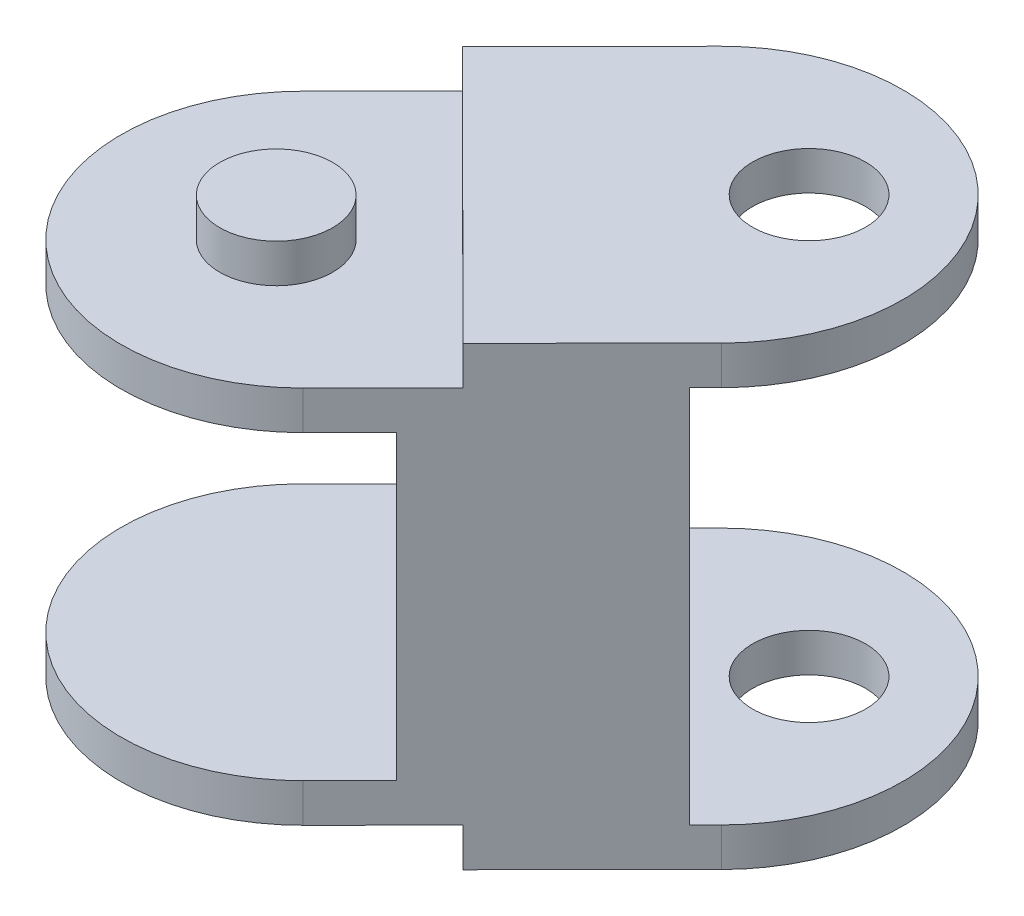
ISO-10303-21;
HEADER;
FILE_DESCRIPTION(('STEP AP214'),'2;1');
FILE_NAME('part.step','',(''),(''),'','','');
FILE_SCHEMA(('AUTOMOTIVE_DESIGN { 1 0 10303 214 1 1 1 1 }'));
ENDSEC;
DATA;
#1=APPLICATION_CONTEXT('core data for automotive mechanical design processes');
#2=APPLICATION_PROTOCOL_DEFINITION('international standard','automotive_design',2000,#1);
#3=PRODUCT_CONTEXT('',#1,'mechanical');
#4=PRODUCT('Part','Part','',(#3));
#5=PRODUCT_RELATED_PRODUCT_CATEGORY('part','',(#4));
#6=PRODUCT_DEFINITION_FORMATION('','',#4);
#7=PRODUCT_DEFINITION_CONTEXT('part definition',#1,'design');
#8=PRODUCT_DEFINITION('design','',#6,#7);
#9=PRODUCT_DEFINITION_SHAPE('','',#8);
#10=(LENGTH_UNIT() NAMED_UNIT(*) SI_UNIT(.MILLI.,.METRE.));
#11=(NAMED_UNIT(*) PLANE_ANGLE_UNIT() SI_UNIT($,.RADIAN.));
#12=(NAMED_UNIT(*) SI_UNIT($,.STERADIAN.) SOLID_ANGLE_UNIT());
#13=UNCERTAINTY_MEASURE_WITH_UNIT(LENGTH_MEASURE(1.E-05),#10,'distance_accuracy_value','');
#14=(GEOMETRIC_REPRESENTATION_CONTEXT(3) GLOBAL_UNCERTAINTY_ASSIGNED_CONTEXT((#13)) GLOBAL_UNIT_ASSIGNED_CONTEXT((#10,
#11,#12)) REPRESENTATION_CONTEXT('',''));
#15=CARTESIAN_POINT('',(0.,0.,0.));
#16=DIRECTION('',(0.,0.,1.));
#17=DIRECTION('',(1.,0.,0.));
#18=AXIS2_PLACEMENT_3D('',#15,#16,#17);
#19=CARTESIAN_POINT('',(-554.0128570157,20.1,16.2439000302));
#20=DIRECTION('',(0.,1.,0.));
#21=DIRECTION('',(0.,0.,1.));
#22=AXIS2_PLACEMENT_3D('',#19,#20,#21);
#23=PLANE('',#22);
#24=CARTESIAN_POINT('',(-554.0128570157,20.1,16.2439000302));
#25=DIRECTION('',(0.,-1.,0.));
#26=DIRECTION('',(0.,0.,-1.));
#27=AXIS2_PLACEMENT_3D('',#24,#25,#26);
#28=CIRCLE('',#27,2.99999999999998);
#29=CARTESIAN_POINT('',(-554.0128570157,20.1,13.2439000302));
#30=VERTEX_POINT('',#29);
#31=EDGE_CURVE('E381',#30,#30,#28,.T.);
#32=ORIENTED_EDGE('',*,*,#31,.F.);
#33=EDGE_LOOP('',(#32));
#34=FACE_BOUND('',#33,.T.);
#35=ADVANCED_FACE('F17',(#34),#23,.T.);
#36=CARTESIAN_POINT('',(-543.068753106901,8.,5.26771719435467));
#37=DIRECTION('',(0.706071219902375,0.,-0.708140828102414));
#38=DIRECTION('',(-0.708140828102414,0.,-0.706071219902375));
#39=AXIS2_PLACEMENT_3D('',#36,#37,#38);
#40=PLANE('',#39);
#41=DIRECTION('',(0.,1.,0.));
#42=VECTOR('',#41,1.);
#43=CARTESIAN_POINT('',(-549.902312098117,20.1,-1.5458700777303));
#44=LINE('',#43,#42);
#45=CARTESIAN_POINT('',(-549.902312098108,18.05,-1.54587007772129));
#46=VERTEX_POINT('',#45);
#47=CARTESIAN_POINT('',(-549.902312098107,16.,-1.54587007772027));
#48=VERTEX_POINT('',#47);
#49=EDGE_CURVE('E390',#46,#48,#44,.F.);
#50=ORIENTED_EDGE('',*,*,#49,.F.);
#51=DIRECTION('',(-0.708140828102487,0.,-0.706071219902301));
#52=VECTOR('',#51,1.);
#53=CARTESIAN_POINT('',(-549.273477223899,18.05,-0.918873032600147));
#54=LINE('',#53,#52);
#55=CARTESIAN_POINT('',(-549.273477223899,18.05,-0.918873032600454));
#56=VERTEX_POINT('',#55);
#57=EDGE_CURVE('E393',#56,#46,#54,.T.);
#58=ORIENTED_EDGE('',*,*,#57,.F.);
#59=DIRECTION('',(0.,-1.,0.));
#60=VECTOR('',#59,1.);
#61=CARTESIAN_POINT('',(-549.273477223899,17.025,-0.918873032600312));
#62=LINE('',#61,#60);
#63=CARTESIAN_POINT('',(-549.273477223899,16.,-0.91887303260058));
#64=VERTEX_POINT('',#63);
#65=EDGE_CURVE('E378',#56,#64,#62,.T.);
#66=ORIENTED_EDGE('',*,*,#65,.T.);
#67=DIRECTION('',(-0.708140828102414,0.,-0.706071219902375));
#68=VECTOR('',#67,1.);
#69=CARTESIAN_POINT('',(-543.068753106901,16.,5.26771719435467));
#70=LINE('',#69,#68);
#71=EDGE_CURVE('E236',#64,#48,#70,.T.);
#72=ORIENTED_EDGE('',*,*,#71,.T.);
#73=EDGE_LOOP('',(#50,#58,#66,#72));
#74=FACE_BOUND('',#73,.T.);
#75=ADVANCED_FACE('F798',(#74),#40,.T.);
#76=CARTESIAN_POINT('',(-556.220511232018,8.,5.5698069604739));
#77=DIRECTION('',(0.706071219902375,0.,-0.708140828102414));
#78=DIRECTION('',(-0.708140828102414,0.,-0.706071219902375));
#79=AXIS2_PLACEMENT_3D('',#76,#77,#78);
#80=PLANE('',#79);
#81=DIRECTION('',(0.,1.,0.));
#82=VECTOR('',#81,1.);
#83=CARTESIAN_POINT('',(-555.831033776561,8.,5.95814613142));
#84=LINE('',#83,#82);
#85=CARTESIAN_POINT('',(-555.831033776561,10.,5.95814613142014));
#86=VERTEX_POINT('',#85);
#87=CARTESIAN_POINT('',(-555.831033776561,16.,5.95814613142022));
#88=VERTEX_POINT('',#87);
#89=EDGE_CURVE('E230',#86,#88,#84,.T.);
#90=ORIENTED_EDGE('',*,*,#89,.T.);
#91=DIRECTION('',(-0.708140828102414,0.,-0.706071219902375));
#92=VECTOR('',#91,1.);
#93=CARTESIAN_POINT('',(-556.220511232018,16.,5.5698069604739));
#94=LINE('',#93,#92);
#95=CARTESIAN_POINT('',(-556.609988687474,16.,5.18146778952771));
#96=VERTEX_POINT('',#95);
#97=EDGE_CURVE('E225',#96,#88,#94,.F.);
#98=ORIENTED_EDGE('',*,*,#97,.F.);
#99=DIRECTION('',(0.,1.,0.));
#100=VECTOR('',#99,1.);
#101=CARTESIAN_POINT('',(-556.609988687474,20.1,5.18146778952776));
#102=LINE('',#101,#100);
#103=CARTESIAN_POINT('',(-556.609988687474,10.,5.18146778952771));
#104=VERTEX_POINT('',#103);
#105=EDGE_CURVE('E229',#104,#96,#102,.T.);
#106=ORIENTED_EDGE('',*,*,#105,.F.);
#107=DIRECTION('',(-0.708140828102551,0.,-0.706071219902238));
#108=VECTOR('',#107,1.);
#109=CARTESIAN_POINT('',(-555.831033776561,10.,5.95814613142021));
#110=LINE('',#109,#108);
#111=EDGE_CURVE('E407',#86,#104,#110,.T.);
#112=ORIENTED_EDGE('',*,*,#111,.F.);
#113=EDGE_LOOP('',(#90,#98,#106,#112));
#114=FACE_BOUND('',#113,.T.);
#115=ADVANCED_FACE('F227',(#114),#80,.F.);
#116=CARTESIAN_POINT('',(-550.571941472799,8.,-0.0953196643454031));
#117=DIRECTION('',(-0.706071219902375,0.,0.708140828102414));
#118=DIRECTION('',(0.708140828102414,0.,0.706071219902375));
#119=AXIS2_PLACEMENT_3D('',#116,#117,#118);
#120=PLANE('',#119);
#121=DIRECTION('',(0.,1.,0.));
#122=VECTOR('',#121,1.);
#123=CARTESIAN_POINT('',(-550.961418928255,20.1,-0.483658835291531));
#124=LINE('',#123,#122);
#125=CARTESIAN_POINT('',(-550.961418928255,16.,-0.483658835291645));
#126=VERTEX_POINT('',#125);
#127=CARTESIAN_POINT('',(-550.961418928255,10.,-0.483658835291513));
#128=VERTEX_POINT('',#127);
#129=EDGE_CURVE('E424',#126,#128,#124,.F.);
#130=ORIENTED_EDGE('',*,*,#129,.F.);
#131=DIRECTION('',(0.708140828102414,0.,0.706071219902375));
#132=VECTOR('',#131,1.);
#133=CARTESIAN_POINT('',(-550.571941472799,16.,-0.0953196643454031));
#134=LINE('',#133,#132);
#135=CARTESIAN_POINT('',(-550.182464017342,16.,0.293019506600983));
#136=VERTEX_POINT('',#135);
#137=EDGE_CURVE('E235',#136,#126,#134,.F.);
#138=ORIENTED_EDGE('',*,*,#137,.F.);
#139=DIRECTION('',(0.,1.,0.));
#140=VECTOR('',#139,1.);
#141=CARTESIAN_POINT('',(-550.182464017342,8.,0.293019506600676));
#142=LINE('',#141,#140);
#143=CARTESIAN_POINT('',(-550.182464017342,10.,0.293019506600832));
#144=VERTEX_POINT('',#143);
#145=EDGE_CURVE('E436',#136,#144,#142,.F.);
#146=ORIENTED_EDGE('',*,*,#145,.T.);
#147=DIRECTION('',(0.7081408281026,0.,0.706071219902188));
#148=VECTOR('',#147,1.);
#149=CARTESIAN_POINT('',(-550.961418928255,10.,-0.483658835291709));
#150=LINE('',#149,#148);
#151=EDGE_CURVE('E402',#128,#144,#150,.T.);
#152=ORIENTED_EDGE('',*,*,#151,.F.);
#153=EDGE_LOOP('',(#130,#138,#146,#152));
#154=FACE_BOUND('',#153,.T.);
#155=ADVANCED_FACE('F792',(#154),#120,.F.);
#156=CARTESIAN_POINT('',(-553.396226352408,10.,2.73724364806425));
#157=DIRECTION('',(0.,-1.,0.));
#158=DIRECTION('',(0.,0.,-1.));
#159=AXIS2_PLACEMENT_3D('',#156,#157,#158);
#160=PLANE('',#159);
#161=ORIENTED_EDGE('',*,*,#151,.T.);
#162=DIRECTION('',(-0.706071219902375,0.,0.708140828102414));
#163=VECTOR('',#162,1.);
#164=CARTESIAN_POINT('',(-553.006748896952,10.,3.12558281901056));
#165=LINE('',#164,#163);
#166=EDGE_CURVE('E432',#144,#86,#165,.T.);
#167=ORIENTED_EDGE('',*,*,#166,.T.);
#168=ORIENTED_EDGE('',*,*,#111,.T.);
#169=DIRECTION('',(-0.706071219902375,0.,0.708140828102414));
#170=VECTOR('',#169,1.);
#171=CARTESIAN_POINT('',(-554.597685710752,10.,3.16326642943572));
#172=LINE('',#171,#170);
#173=EDGE_CURVE('E246',#128,#104,#172,.T.);
#174=ORIENTED_EDGE('',*,*,#173,.F.);
#175=EDGE_LOOP('',(#161,#167,#168,#174));
#176=FACE_BOUND('',#175,.T.);
#177=ADVANCED_FACE('F788',(#176),#160,.T.);
#178=CARTESIAN_POINT('',(-554.0128570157,-4.1,16.2439000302));
#179=DIRECTION('',(0.,-1.,0.));
#180=DIRECTION('',(0.,0.,-1.));
#181=AXIS2_PLACEMENT_3D('',#178,#179,#180);
#182=PLANE('',#181);
#183=CARTESIAN_POINT('',(-554.0128570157,-4.1,16.2439000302));
#184=DIRECTION('',(0.,-1.,0.));
#185=DIRECTION('',(0.,0.,-1.));
#186=AXIS2_PLACEMENT_3D('',#183,#184,#185);
#187=CIRCLE('',#186,2.99999999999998);
#188=CARTESIAN_POINT('',(-554.0128570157,-4.1,13.2439000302));
#189=VERTEX_POINT('',#188);
#190=EDGE_CURVE('E435',#189,#189,#187,.F.);
#191=ORIENTED_EDGE('',*,*,#190,.F.);
#192=EDGE_LOOP('',(#191));
#193=FACE_BOUND('',#192,.T.);
#194=ADVANCED_FACE('F785',(#193),#182,.T.);
#195=CARTESIAN_POINT('',(-536.008040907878,18.05,-1.81369108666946));
#196=DIRECTION('',(0.,-1.,0.));
#197=DIRECTION('',(0.,0.,-1.));
#198=AXIS2_PLACEMENT_3D('',#195,#196,#197);
#199=PLANE('',#198);
#200=CARTESIAN_POINT('',(-539.891432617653,18.05,2.08108346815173));
#201=DIRECTION('',(0.,-1.,0.));
#202=DIRECTION('',(0.,0.,-1.));
#203=AXIS2_PLACEMENT_3D('',#200,#201,#202);
#204=CIRCLE('',#203,2.99999999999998);
#205=CARTESIAN_POINT('',(-539.891432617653,18.05,-0.918916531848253));
#206=VERTEX_POINT('',#205);
#207=EDGE_CURVE('E20',#206,#206,#204,.F.);
#208=ORIENTED_EDGE('',*,*,#207,.T.);
#209=EDGE_LOOP('',(#208));
#210=FACE_BOUND('',#209,.T.);
#211=ORIENTED_EDGE('',*,*,#57,.T.);
#212=DIRECTION('',(-0.706071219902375,0.,0.708140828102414));
#213=VECTOR('',#212,1.);
#214=CARTESIAN_POINT('',(-554.597685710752,18.05,3.16326642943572));
#215=LINE('',#214,#213);
#216=CARTESIAN_POINT('',(-549.055026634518,18.05,-2.3956390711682));
#217=VERTEX_POINT('',#216);
#218=EDGE_CURVE('E247',#217,#46,#215,.T.);
#219=ORIENTED_EDGE('',*,*,#218,.F.);
#220=CARTESIAN_POINT('',(-542.22146764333,18.05,4.4179482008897));
#221=DIRECTION('',(0.,-1.,0.));
#222=DIRECTION('',(0.,0.,-1.));
#223=AXIS2_PLACEMENT_3D('',#220,#221,#222);
#224=CIRCLE('',#223,9.65000000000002);
#225=CARTESIAN_POINT('',(-535.387908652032,18.05,11.231535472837));
#226=VERTEX_POINT('',#225);
#227=EDGE_CURVE('E387',#226,#217,#224,.F.);
#228=ORIENTED_EDGE('',*,*,#227,.F.);
#229=DIRECTION('',(-0.706071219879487,0.,0.708140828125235));
#230=VECTOR('',#229,1.);
#231=CARTESIAN_POINT('',(-535.387908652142,18.05,11.2315354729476));
#232=LINE('',#231,#230);
#233=CARTESIAN_POINT('',(-536.235194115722,18.05,12.0813044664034));
#234=VERTEX_POINT('',#233);
#235=EDGE_CURVE('E398',#226,#234,#232,.T.);
#236=ORIENTED_EDGE('',*,*,#235,.T.);
#237=DIRECTION('',(-0.708140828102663,0.,-0.706071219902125));
#238=VECTOR('',#237,1.);
#239=CARTESIAN_POINT('',(-536.235194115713,18.05,12.0813044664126));
#240=LINE('',#239,#238);
#241=CARTESIAN_POINT('',(-536.864028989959,18.05,11.4543074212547));
#242=VERTEX_POINT('',#241);
#243=EDGE_CURVE('E139',#234,#242,#240,.T.);
#244=ORIENTED_EDGE('',*,*,#243,.T.);
#245=CARTESIAN_POINT('',(-539.891432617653,18.05,2.08108346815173));
#246=DIRECTION('',(0.,-1.,0.));
#247=DIRECTION('',(0.,0.,-1.));
#248=AXIS2_PLACEMENT_3D('',#245,#246,#247);
#249=CIRCLE('',#248,9.85000000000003);
#250=EDGE_CURVE('E498',#242,#56,#249,.T.);
#251=ORIENTED_EDGE('',*,*,#250,.T.);
#252=EDGE_LOOP('',(#211,#219,#228,#236,#244,#251));
#253=FACE_BOUND('',#252,.T.);
#254=ADVANCED_FACE('F507',(#210,#253),#199,.T.);
#255=CARTESIAN_POINT('',(-539.891432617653,19.075,2.08108346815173));
#256=DIRECTION('',(0.,-1.,0.));
#257=DIRECTION('',(0.,0.,-1.));
#258=AXIS2_PLACEMENT_3D('',#255,#256,#257);
#259=CYLINDRICAL_SURFACE('',#258,2.99999999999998);
#260=ORIENTED_EDGE('',*,*,#207,.F.);
#261=EDGE_LOOP('',(#260));
#262=FACE_BOUND('',#261,.T.);
#263=CARTESIAN_POINT('',(-539.891432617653,20.1,2.08108346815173));
#264=DIRECTION('',(0.,-1.,0.));
#265=DIRECTION('',(0.,0.,-1.));
#266=AXIS2_PLACEMENT_3D('',#263,#264,#265);
#267=CIRCLE('',#266,2.99999999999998);
#268=CARTESIAN_POINT('',(-539.891432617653,20.1,-0.918916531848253));
#269=VERTEX_POINT('',#268);
#270=EDGE_CURVE('E383',#269,#269,#267,.F.);
#271=ORIENTED_EDGE('',*,*,#270,.T.);
#272=EDGE_LOOP('',(#271));
#273=FACE_BOUND('',#272,.T.);
#274=ADVANCED_FACE('F509',(#262,#273),#259,.F.);
#275=CARTESIAN_POINT('',(-554.0128570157,19.075,16.2439000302));
#276=DIRECTION('',(0.,-1.,0.));
#277=DIRECTION('',(0.,0.,-1.));
#278=AXIS2_PLACEMENT_3D('',#275,#276,#277);
#279=CYLINDRICAL_SURFACE('',#278,2.99999999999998);
#280=ORIENTED_EDGE('',*,*,#31,.T.);
#281=EDGE_LOOP('',(#280));
#282=FACE_BOUND('',#281,.T.);
#283=CARTESIAN_POINT('',(-554.0128570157,18.05,16.2439000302));
#284=DIRECTION('',(0.,-1.,0.));
#285=DIRECTION('',(0.,0.,-1.));
#286=AXIS2_PLACEMENT_3D('',#283,#284,#285);
#287=CIRCLE('',#286,2.99999999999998);
#288=CARTESIAN_POINT('',(-554.0128570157,18.05,13.2439000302));
#289=VERTEX_POINT('',#288);
#290=EDGE_CURVE('E284',#289,#289,#287,.F.);
#291=ORIENTED_EDGE('',*,*,#290,.T.);
#292=EDGE_LOOP('',(#291));
#293=FACE_BOUND('',#292,.T.);
#294=ADVANCED_FACE('F512',(#282,#293),#279,.T.);
#295=CARTESIAN_POINT('',(-554.597685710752,20.1,3.16326642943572));
#296=DIRECTION('',(-0.708140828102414,0.,-0.706071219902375));
#297=DIRECTION('',(-0.706071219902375,0.,0.708140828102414));
#298=AXIS2_PLACEMENT_3D('',#295,#296,#297);
#299=PLANE('',#298);
#300=DIRECTION('',(-0.706071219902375,0.,0.708140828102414));
#301=VECTOR('',#300,1.);
#302=CARTESIAN_POINT('',(-554.597685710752,16.,3.16326642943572));
#303=LINE('',#302,#301);
#304=EDGE_CURVE('E410',#48,#126,#303,.T.);
#305=ORIENTED_EDGE('',*,*,#304,.T.);
#306=ORIENTED_EDGE('',*,*,#129,.T.);
#307=ORIENTED_EDGE('',*,*,#173,.T.);
#308=ORIENTED_EDGE('',*,*,#105,.T.);
#309=DIRECTION('',(0.706071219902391,0.,-0.708140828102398));
#310=VECTOR('',#309,1.);
#311=CARTESIAN_POINT('',(-560.140344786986,16.,8.72217193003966));
#312=LINE('',#311,#310);
#313=CARTESIAN_POINT('',(-560.140344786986,16.,8.72217193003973));
#314=VERTEX_POINT('',#313);
#315=EDGE_CURVE('E243',#314,#96,#312,.T.);
#316=ORIENTED_EDGE('',*,*,#315,.F.);
#317=DIRECTION('',(0.,-1.,0.));
#318=VECTOR('',#317,1.);
#319=CARTESIAN_POINT('',(-560.140344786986,20.1,8.72217193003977));
#320=LINE('',#319,#318);
#321=CARTESIAN_POINT('',(-560.140344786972,18.05,8.72217193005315));
#322=VERTEX_POINT('',#321);
#323=EDGE_CURVE('E375',#322,#314,#320,.T.);
#324=ORIENTED_EDGE('',*,*,#323,.F.);
#325=DIRECTION('',(0.706071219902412,0.,-0.708140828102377));
#326=VECTOR('',#325,1.);
#327=CARTESIAN_POINT('',(-560.140344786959,18.05,8.72217193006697));
#328=LINE('',#327,#326);
#329=CARTESIAN_POINT('',(-555.90391746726,18.05,4.47332696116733));
#330=VERTEX_POINT('',#329);
#331=EDGE_CURVE('E275',#322,#330,#328,.T.);
#332=ORIENTED_EDGE('',*,*,#331,.T.);
#333=DIRECTION('',(0.,1.,0.));
#334=VECTOR('',#333,1.);
#335=CARTESIAN_POINT('',(-555.90391746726,19.075,4.47332696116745));
#336=LINE('',#335,#334);
#337=CARTESIAN_POINT('',(-555.90391746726,20.1,4.47332696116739));
#338=VERTEX_POINT('',#337);
#339=EDGE_CURVE('E293',#338,#330,#336,.F.);
#340=ORIENTED_EDGE('',*,*,#339,.F.);
#341=DIRECTION('',(0.706071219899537,0.,-0.708140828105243));
#342=VECTOR('',#341,1.);
#343=CARTESIAN_POINT('',(-555.90391746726,20.1,4.47332696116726));
#344=LINE('',#343,#342);
#345=CARTESIAN_POINT('',(-549.055026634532,20.1,-2.39563907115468));
#346=VERTEX_POINT('',#345);
#347=EDGE_CURVE('E300',#338,#346,#344,.T.);
#348=ORIENTED_EDGE('',*,*,#347,.T.);
#349=DIRECTION('',(0.,-1.,0.));
#350=VECTOR('',#349,1.);
#351=CARTESIAN_POINT('',(-549.055026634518,20.1,-2.39563907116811));
#352=LINE('',#351,#350);
#353=EDGE_CURVE('E304',#217,#346,#352,.F.);
#354=ORIENTED_EDGE('',*,*,#353,.F.);
#355=ORIENTED_EDGE('',*,*,#218,.T.);
#356=ORIENTED_EDGE('',*,*,#49,.T.);
#357=EDGE_LOOP('',(#305,#306,#307,#308,#316,#324,#332,#340,#348,#354,#355,#356));
#358=FACE_BOUND('',#357,.T.);
#359=ADVANCED_FACE('F241',(#358),#299,.T.);
#360=CARTESIAN_POINT('',(-553.006748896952,8.,3.12558281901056));
#361=DIRECTION('',(-0.708140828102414,0.,-0.706071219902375));
#362=DIRECTION('',(-0.706071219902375,0.,0.708140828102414));
#363=AXIS2_PLACEMENT_3D('',#360,#361,#362);
#364=PLANE('',#363);
#365=ORIENTED_EDGE('',*,*,#145,.F.);
#366=DIRECTION('',(0.706071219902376,0.,-0.708140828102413));
#367=VECTOR('',#366,1.);
#368=CARTESIAN_POINT('',(-555.831033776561,16.,5.95814613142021));
#369=LINE('',#368,#367);
#370=EDGE_CURVE('E255',#88,#136,#369,.T.);
#371=ORIENTED_EDGE('',*,*,#370,.F.);
#372=ORIENTED_EDGE('',*,*,#89,.F.);
#373=ORIENTED_EDGE('',*,*,#166,.F.);
#374=EDGE_LOOP('',(#365,#371,#372,#373));
#375=FACE_BOUND('',#374,.T.);
#376=ADVANCED_FACE('F770',(#375),#364,.F.);
#377=CARTESIAN_POINT('',(-554.0128570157,-3.075,16.2439000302));
#378=DIRECTION('',(0.,-1.,0.));
#379=DIRECTION('',(0.,0.,-1.));
#380=AXIS2_PLACEMENT_3D('',#377,#378,#379);
#381=CYLINDRICAL_SURFACE('',#380,2.99999999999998);
#382=CARTESIAN_POINT('',(-554.0128570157,-2.05,16.2439000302));
#383=DIRECTION('',(0.,-1.,0.));
#384=DIRECTION('',(0.,0.,-1.));
#385=AXIS2_PLACEMENT_3D('',#382,#383,#384);
#386=CIRCLE('',#385,2.99999999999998);
#387=CARTESIAN_POINT('',(-554.0128570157,-2.05,13.2439000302));
#388=VERTEX_POINT('',#387);
#389=EDGE_CURVE('E473',#388,#388,#386,.F.);
#390=ORIENTED_EDGE('',*,*,#389,.F.);
#391=EDGE_LOOP('',(#390));
#392=FACE_BOUND('',#391,.T.);
#393=ORIENTED_EDGE('',*,*,#190,.T.);
#394=EDGE_LOOP('',(#393));
#395=FACE_BOUND('',#394,.T.);
#396=ADVANCED_FACE('F760',(#392,#395),#381,.T.);
#397=CARTESIAN_POINT('',(-539.891432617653,-3.075,2.08108346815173));
#398=DIRECTION('',(0.,-1.,0.));
#399=DIRECTION('',(0.,0.,-1.));
#400=AXIS2_PLACEMENT_3D('',#397,#398,#399);
#401=CYLINDRICAL_SURFACE('',#400,2.99999999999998);
#402=CARTESIAN_POINT('',(-539.891432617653,-4.1,2.08108346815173));
#403=DIRECTION('',(0.,-1.,0.));
#404=DIRECTION('',(0.,0.,-1.));
#405=AXIS2_PLACEMENT_3D('',#402,#403,#404);
#406=CIRCLE('',#405,2.99999999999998);
#407=CARTESIAN_POINT('',(-539.891432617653,-4.1,-0.918916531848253));
#408=VERTEX_POINT('',#407);
#409=EDGE_CURVE('E478',#408,#408,#406,.F.);
#410=ORIENTED_EDGE('',*,*,#409,.F.);
#411=EDGE_LOOP('',(#410));
#412=FACE_BOUND('',#411,.T.);
#413=CARTESIAN_POINT('',(-539.891432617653,-2.05,2.08108346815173));
#414=DIRECTION('',(0.,-1.,0.));
#415=DIRECTION('',(0.,0.,-1.));
#416=AXIS2_PLACEMENT_3D('',#413,#414,#415);
#417=CIRCLE('',#416,2.99999999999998);
#418=CARTESIAN_POINT('',(-539.891432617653,-2.05,-0.918916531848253));
#419=VERTEX_POINT('',#418);
#420=EDGE_CURVE('E345',#419,#419,#417,.F.);
#421=ORIENTED_EDGE('',*,*,#420,.T.);
#422=EDGE_LOOP('',(#421));
#423=FACE_BOUND('',#422,.T.);
#424=ADVANCED_FACE('F757',(#412,#423),#401,.F.);
#425=CARTESIAN_POINT('',(-539.891432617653,17.025,2.08108346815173));
#426=DIRECTION('',(0.,-1.,0.));
#427=DIRECTION('',(0.,0.,-1.));
#428=AXIS2_PLACEMENT_3D('',#425,#426,#427);
#429=CYLINDRICAL_SURFACE('',#428,9.85000000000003);
#430=ORIENTED_EDGE('',*,*,#250,.F.);
#431=DIRECTION('',(0.,1.,0.));
#432=VECTOR('',#431,1.);
#433=CARTESIAN_POINT('',(-536.864028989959,8.,11.4543074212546));
#434=LINE('',#433,#432);
#435=CARTESIAN_POINT('',(-536.864028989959,16.,11.4543074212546));
#436=VERTEX_POINT('',#435);
#437=EDGE_CURVE('E344',#436,#242,#434,.T.);
#438=ORIENTED_EDGE('',*,*,#437,.F.);
#439=CARTESIAN_POINT('',(-539.891432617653,16.,2.08108346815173));
#440=DIRECTION('',(0.,-1.,0.));
#441=DIRECTION('',(0.,0.,-1.));
#442=AXIS2_PLACEMENT_3D('',#439,#440,#441);
#443=CIRCLE('',#442,9.85000000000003);
#444=CARTESIAN_POINT('',(-537.650352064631,16.,11.672749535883));
#445=VERTEX_POINT('',#444);
#446=EDGE_CURVE('E495',#436,#445,#443,.T.);
#447=ORIENTED_EDGE('',*,*,#446,.T.);
#448=CARTESIAN_POINT('',(-539.891432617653,16.,2.08108346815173));
#449=DIRECTION('',(0.,-1.,0.));
#450=DIRECTION('',(0.,0.,-1.));
#451=AXIS2_PLACEMENT_3D('',#448,#449,#450);
#452=CIRCLE('',#451,9.85000000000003);
#453=EDGE_CURVE('E259',#64,#445,#452,.F.);
#454=ORIENTED_EDGE('',*,*,#453,.F.);
#455=ORIENTED_EDGE('',*,*,#65,.F.);
#456=EDGE_LOOP('',(#430,#438,#447,#454,#455));
#457=FACE_BOUND('',#456,.T.);
#458=ADVANCED_FACE('F759',(#457),#429,.F.);
#459=CARTESIAN_POINT('',(-539.891432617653,16.,2.08108346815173));
#460=DIRECTION('',(0.,-1.,0.));
#461=DIRECTION('',(0.,0.,-1.));
#462=AXIS2_PLACEMENT_3D('',#459,#460,#461);
#463=PLANE('',#462);
#464=ORIENTED_EDGE('',*,*,#446,.F.);
#465=DIRECTION('',(-0.708140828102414,0.,-0.706071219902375));
#466=VECTOR('',#465,1.);
#467=CARTESIAN_POINT('',(-543.068753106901,16.,5.26771719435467));
#468=LINE('',#467,#466);
#469=CARTESIAN_POINT('',(-537.149120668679,16.,11.1700489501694));
#470=VERTEX_POINT('',#469);
#471=EDGE_CURVE('E341',#470,#436,#468,.F.);
#472=ORIENTED_EDGE('',*,*,#471,.F.);
#473=DIRECTION('',(0.706071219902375,0.,-0.708140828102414));
#474=VECTOR('',#473,1.);
#475=CARTESIAN_POINT('',(-541.032512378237,16.,15.0648235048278));
#476=LINE('',#475,#474);
#477=EDGE_CURVE('E329',#470,#445,#476,.F.);
#478=ORIENTED_EDGE('',*,*,#477,.T.);
#479=EDGE_LOOP('',(#464,#472,#478));
#480=FACE_BOUND('',#479,.T.);
#481=ADVANCED_FACE('F767',(#480),#463,.F.);
#482=CARTESIAN_POINT('',(-542.22146764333,20.1,4.4179482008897));
#483=DIRECTION('',(0.,-1.,0.));
#484=DIRECTION('',(0.,0.,-1.));
#485=AXIS2_PLACEMENT_3D('',#482,#483,#484);
#486=CYLINDRICAL_SURFACE('',#485,9.65000000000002);
#487=CARTESIAN_POINT('',(-542.22146764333,20.1,4.4179482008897));
#488=DIRECTION('',(0.,-1.,0.));
#489=DIRECTION('',(0.,0.,-1.));
#490=AXIS2_PLACEMENT_3D('',#487,#488,#489);
#491=CIRCLE('',#490,9.65000000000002);
#492=CARTESIAN_POINT('',(-535.387908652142,20.1,11.2315354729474));
#493=VERTEX_POINT('',#492);
#494=EDGE_CURVE('E303',#346,#493,#491,.T.);
#495=ORIENTED_EDGE('',*,*,#494,.T.);
#496=DIRECTION('',(0.,1.,0.));
#497=VECTOR('',#496,1.);
#498=CARTESIAN_POINT('',(-535.387908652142,20.1,11.2315354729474));
#499=LINE('',#498,#497);
#500=EDGE_CURVE('E297',#226,#493,#499,.T.);
#501=ORIENTED_EDGE('',*,*,#500,.F.);
#502=ORIENTED_EDGE('',*,*,#227,.T.);
#503=ORIENTED_EDGE('',*,*,#353,.T.);
#504=EDGE_LOOP('',(#495,#501,#502,#503));
#505=FACE_BOUND('',#504,.T.);
#506=ADVANCED_FACE('F520',(#505),#486,.T.);
#507=CARTESIAN_POINT('',(-547.764126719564,20.1,9.97685370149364));
#508=DIRECTION('',(0.,-1.,0.));
#509=DIRECTION('',(0.,0.,-1.));
#510=AXIS2_PLACEMENT_3D('',#507,#508,#509);
#511=PLANE('',#510);
#512=ORIENTED_EDGE('',*,*,#270,.F.);
#513=EDGE_LOOP('',(#512));
#514=FACE_BOUND('',#513,.T.);
#515=DIRECTION('',(0.706071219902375,0.,-0.708140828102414));
#516=VECTOR('',#515,1.);
#517=CARTESIAN_POINT('',(-540.930567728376,20.1,16.7904409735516));
#518=LINE('',#517,#516);
#519=CARTESIAN_POINT('',(-542.236799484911,20.1,18.1005015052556));
#520=VERTEX_POINT('',#519);
#521=EDGE_CURVE('E288',#493,#520,#518,.F.);
#522=ORIENTED_EDGE('',*,*,#521,.F.);
#523=ORIENTED_EDGE('',*,*,#494,.F.);
#524=ORIENTED_EDGE('',*,*,#347,.F.);
#525=DIRECTION('',(0.708140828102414,0.,0.706071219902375));
#526=VECTOR('',#525,1.);
#527=CARTESIAN_POINT('',(-549.070358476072,20.1,11.2869142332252));
#528=LINE('',#527,#526);
#529=EDGE_CURVE('E279',#520,#338,#528,.F.);
#530=ORIENTED_EDGE('',*,*,#529,.F.);
#531=EDGE_LOOP('',(#522,#523,#524,#530));
#532=FACE_BOUND('',#531,.T.);
#533=ADVANCED_FACE('F516',(#514,#532),#511,.F.);
#534=CARTESIAN_POINT('',(-549.070358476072,19.075,11.2869142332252));
#535=DIRECTION('',(-0.706071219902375,0.,0.708140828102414));
#536=DIRECTION('',(0.708140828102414,0.,0.706071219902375));
#537=AXIS2_PLACEMENT_3D('',#534,#535,#536);
#538=PLANE('',#537);
#539=DIRECTION('',(0.,1.,0.));
#540=VECTOR('',#539,1.);
#541=CARTESIAN_POINT('',(-542.236799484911,20.1,18.1005015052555));
#542=LINE('',#541,#540);
#543=CARTESIAN_POINT('',(-542.236799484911,18.05,18.1005015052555));
#544=VERTEX_POINT('',#543);
#545=EDGE_CURVE('E272',#520,#544,#542,.F.);
#546=ORIENTED_EDGE('',*,*,#545,.F.);
#547=ORIENTED_EDGE('',*,*,#529,.T.);
#548=ORIENTED_EDGE('',*,*,#339,.T.);
#549=DIRECTION('',(0.708140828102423,0.,0.706071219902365));
#550=VECTOR('',#549,1.);
#551=CARTESIAN_POINT('',(-555.90391746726,18.05,4.47332696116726));
#552=LINE('',#551,#550);
#553=EDGE_CURVE('E278',#330,#544,#552,.T.);
#554=ORIENTED_EDGE('',*,*,#553,.T.);
#555=EDGE_LOOP('',(#546,#547,#548,#554));
#556=FACE_BOUND('',#555,.T.);
#557=ADVANCED_FACE('F519',(#556),#538,.T.);
#558=CARTESIAN_POINT('',(-554.948401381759,18.05,17.1821866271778));
#559=DIRECTION('',(0.,-1.,0.));
#560=DIRECTION('',(0.,0.,-1.));
#561=AXIS2_PLACEMENT_3D('',#558,#559,#560);
#562=PLANE('',#561);
#563=ORIENTED_EDGE('',*,*,#290,.F.);
#564=EDGE_LOOP('',(#563));
#565=FACE_BOUND('',#564,.T.);
#566=DIRECTION('',(0.706071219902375,0.,-0.708140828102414));
#567=VECTOR('',#566,1.);
#568=CARTESIAN_POINT('',(-540.930567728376,18.05,16.7904409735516));
#569=LINE('',#568,#567);
#570=CARTESIAN_POINT('',(-546.47322680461,18.05,22.3493464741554));
#571=VERTEX_POINT('',#570);
#572=EDGE_CURVE('E270',#544,#571,#569,.F.);
#573=ORIENTED_EDGE('',*,*,#572,.F.);
#574=ORIENTED_EDGE('',*,*,#553,.F.);
#575=ORIENTED_EDGE('',*,*,#331,.F.);
#576=CARTESIAN_POINT('',(-553.306785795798,18.05,15.5357592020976));
#577=DIRECTION('',(0.,-1.,0.));
#578=DIRECTION('',(0.,0.,-1.));
#579=AXIS2_PLACEMENT_3D('',#576,#577,#578);
#580=CIRCLE('',#579,9.65000000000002);
#581=EDGE_CURVE('E377',#571,#322,#580,.T.);
#582=ORIENTED_EDGE('',*,*,#581,.F.);
#583=EDGE_LOOP('',(#573,#574,#575,#582));
#584=FACE_BOUND('',#583,.T.);
#585=ADVANCED_FACE('F541',(#565,#584),#562,.F.);
#586=CARTESIAN_POINT('',(-553.306785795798,20.1,15.5357592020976));
#587=DIRECTION('',(0.,-1.,0.));
#588=DIRECTION('',(0.,0.,-1.));
#589=AXIS2_PLACEMENT_3D('',#586,#587,#588);
#590=CYLINDRICAL_SURFACE('',#589,9.65000000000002);
#591=CARTESIAN_POINT('',(-553.306785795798,16.,15.5357592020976));
#592=DIRECTION('',(0.,-1.,0.));
#593=DIRECTION('',(0.,0.,-1.));
#594=AXIS2_PLACEMENT_3D('',#591,#592,#593);
#595=CIRCLE('',#594,9.65000000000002);
#596=CARTESIAN_POINT('',(-546.47322680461,16.,22.3493464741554));
#597=VERTEX_POINT('',#596);
#598=EDGE_CURVE('E254',#597,#314,#595,.T.);
#599=ORIENTED_EDGE('',*,*,#598,.F.);
#600=DIRECTION('',(0.,1.,0.));
#601=VECTOR('',#600,1.);
#602=CARTESIAN_POINT('',(-546.473226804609,20.1,22.3493464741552));
#603=LINE('',#602,#601);
#604=EDGE_CURVE('E267',#571,#597,#603,.F.);
#605=ORIENTED_EDGE('',*,*,#604,.F.);
#606=ORIENTED_EDGE('',*,*,#581,.T.);
#607=ORIENTED_EDGE('',*,*,#323,.T.);
#608=EDGE_LOOP('',(#599,#605,#606,#607));
#609=FACE_BOUND('',#608,.T.);
#610=ADVANCED_FACE('F546',(#609),#590,.T.);
#611=CARTESIAN_POINT('',(-546.95214481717,16.,9.16249174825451));
#612=DIRECTION('',(0.,-1.,0.));
#613=DIRECTION('',(0.,0.,-1.));
#614=AXIS2_PLACEMENT_3D('',#611,#612,#613);
#615=PLANE('',#614);
#616=ORIENTED_EDGE('',*,*,#304,.F.);
#617=ORIENTED_EDGE('',*,*,#71,.F.);
#618=ORIENTED_EDGE('',*,*,#453,.T.);
#619=DIRECTION('',(0.706071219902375,0.,-0.708140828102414));
#620=VECTOR('',#619,1.);
#621=CARTESIAN_POINT('',(-541.032512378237,16.,15.0648235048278));
#622=LINE('',#621,#620);
#623=CARTESIAN_POINT('',(-544.9159040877,16.,18.9595980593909));
#624=VERTEX_POINT('',#623);
#625=EDGE_CURVE('E325',#445,#624,#622,.F.);
#626=ORIENTED_EDGE('',*,*,#625,.T.);
#627=DIRECTION('',(-0.708140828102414,0.,-0.706071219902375));
#628=VECTOR('',#627,1.);
#629=CARTESIAN_POINT('',(-544.458940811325,16.,19.4152258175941));
#630=LINE('',#629,#628);
#631=CARTESIAN_POINT('',(-544.001977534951,16.,19.8708535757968));
#632=VERTEX_POINT('',#631);
#633=EDGE_CURVE('E483',#624,#632,#630,.F.);
#634=ORIENTED_EDGE('',*,*,#633,.T.);
#635=DIRECTION('',(0.706071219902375,0.,-0.708140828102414));
#636=VECTOR('',#635,1.);
#637=CARTESIAN_POINT('',(-540.930567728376,16.,16.7904409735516));
#638=LINE('',#637,#636);
#639=EDGE_CURVE('E269',#597,#632,#638,.T.);
#640=ORIENTED_EDGE('',*,*,#639,.F.);
#641=ORIENTED_EDGE('',*,*,#598,.T.);
#642=ORIENTED_EDGE('',*,*,#315,.T.);
#643=ORIENTED_EDGE('',*,*,#97,.T.);
#644=ORIENTED_EDGE('',*,*,#370,.T.);
#645=ORIENTED_EDGE('',*,*,#137,.T.);
#646=EDGE_LOOP('',(#616,#617,#618,#626,#634,#640,#641,#642,#643,#644,#645));
#647=FACE_BOUND('',#646,.T.);
#648=ADVANCED_FACE('F251',(#647),#615,.T.);
#649=CARTESIAN_POINT('',(-544.458940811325,8.,19.4152258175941));
#650=DIRECTION('',(0.706071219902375,0.,-0.708140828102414));
#651=DIRECTION('',(-0.708140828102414,0.,-0.706071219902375));
#652=AXIS2_PLACEMENT_3D('',#649,#650,#651);
#653=PLANE('',#652);
#654=ORIENTED_EDGE('',*,*,#633,.F.);
#655=DIRECTION('',(0.,1.,0.));
#656=VECTOR('',#655,1.);
#657=CARTESIAN_POINT('',(-544.9159040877,8.,18.959598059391));
#658=LINE('',#657,#656);
#659=CARTESIAN_POINT('',(-544.9159040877,0.,18.959598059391));
#660=VERTEX_POINT('',#659);
#661=EDGE_CURVE('E328',#624,#660,#658,.F.);
#662=ORIENTED_EDGE('',*,*,#661,.T.);
#663=DIRECTION('',(-0.708140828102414,0.,-0.706071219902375));
#664=VECTOR('',#663,1.);
#665=CARTESIAN_POINT('',(-544.458940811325,0.,19.4152258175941));
#666=LINE('',#665,#664);
#667=CARTESIAN_POINT('',(-544.001977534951,0.,19.870853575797));
#668=VERTEX_POINT('',#667);
#669=EDGE_CURVE('E257',#668,#660,#666,.T.);
#670=ORIENTED_EDGE('',*,*,#669,.F.);
#671=DIRECTION('',(0.,1.,0.));
#672=VECTOR('',#671,1.);
#673=CARTESIAN_POINT('',(-544.001977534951,20.1,19.8708535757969));
#674=LINE('',#673,#672);
#675=EDGE_CURVE('E548',#632,#668,#674,.F.);
#676=ORIENTED_EDGE('',*,*,#675,.F.);
#677=EDGE_LOOP('',(#654,#662,#670,#676));
#678=FACE_BOUND('',#677,.T.);
#679=ADVANCED_FACE('F687',(#678),#653,.F.);
#680=CARTESIAN_POINT('',(-542.22146764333,20.1,4.4179482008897));
#681=DIRECTION('',(0.,-1.,0.));
#682=DIRECTION('',(0.,0.,-1.));
#683=AXIS2_PLACEMENT_3D('',#680,#681,#682);
#684=CYLINDRICAL_SURFACE('',#683,9.65000000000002);
#685=CARTESIAN_POINT('',(-542.22146764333,-4.1,4.4179482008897));
#686=DIRECTION('',(0.,-1.,0.));
#687=DIRECTION('',(0.,0.,-1.));
#688=AXIS2_PLACEMENT_3D('',#685,#686,#687);
#689=CIRCLE('',#688,9.65000000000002);
#690=CARTESIAN_POINT('',(-549.055026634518,-4.1,-2.39563907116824));
#691=VERTEX_POINT('',#690);
#692=CARTESIAN_POINT('',(-535.387908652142,-4.1,11.2315354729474));
#693=VERTEX_POINT('',#692);
#694=EDGE_CURVE('E482',#691,#693,#689,.T.);
#695=ORIENTED_EDGE('',*,*,#694,.F.);
#696=DIRECTION('',(0.,1.,0.));
#697=VECTOR('',#696,1.);
#698=CARTESIAN_POINT('',(-549.055026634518,20.1,-2.3956390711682));
#699=LINE('',#698,#697);
#700=CARTESIAN_POINT('',(-549.055026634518,-2.05,-2.39563907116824));
#701=VERTEX_POINT('',#700);
#702=EDGE_CURVE('E597',#701,#691,#699,.F.);
#703=ORIENTED_EDGE('',*,*,#702,.F.);
#704=CARTESIAN_POINT('',(-542.22146764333,-2.05,4.4179482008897));
#705=DIRECTION('',(0.,-1.,0.));
#706=DIRECTION('',(0.,0.,-1.));
#707=AXIS2_PLACEMENT_3D('',#704,#705,#706);
#708=CIRCLE('',#707,9.65000000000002);
#709=CARTESIAN_POINT('',(-535.387908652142,-2.05,11.2315354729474));
#710=VERTEX_POINT('',#709);
#711=EDGE_CURVE('E469',#701,#710,#708,.T.);
#712=ORIENTED_EDGE('',*,*,#711,.T.);
#713=DIRECTION('',(0.,1.,0.));
#714=VECTOR('',#713,1.);
#715=CARTESIAN_POINT('',(-535.387908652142,20.1,11.2315354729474));
#716=LINE('',#715,#714);
#717=EDGE_CURVE('E309',#693,#710,#716,.T.);
#718=ORIENTED_EDGE('',*,*,#717,.F.);
#719=EDGE_LOOP('',(#695,#703,#712,#718));
#720=FACE_BOUND('',#719,.T.);
#721=ADVANCED_FACE('F831',(#720),#684,.T.);
#722=CARTESIAN_POINT('',(-547.764126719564,-4.1,9.97685370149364));
#723=DIRECTION('',(0.,-1.,0.));
#724=DIRECTION('',(0.,0.,-1.));
#725=AXIS2_PLACEMENT_3D('',#722,#723,#724);
#726=PLANE('',#725);
#727=ORIENTED_EDGE('',*,*,#409,.T.);
#728=EDGE_LOOP('',(#727));
#729=FACE_BOUND('',#728,.T.);
#730=ORIENTED_EDGE('',*,*,#694,.T.);
#731=DIRECTION('',(0.706071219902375,0.,-0.708140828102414));
#732=VECTOR('',#731,1.);
#733=CARTESIAN_POINT('',(-540.930567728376,-4.10000000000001,16.7904409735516));
#734=LINE('',#733,#732);
#735=CARTESIAN_POINT('',(-542.236799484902,-4.10000000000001,18.1005015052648));
#736=VERTEX_POINT('',#735);
#737=EDGE_CURVE('E312',#736,#693,#734,.T.);
#738=ORIENTED_EDGE('',*,*,#737,.F.);
#739=DIRECTION('',(0.708140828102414,0.,0.706071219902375));
#740=VECTOR('',#739,1.);
#741=CARTESIAN_POINT('',(-549.070358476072,-4.1,11.2869142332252));
#742=LINE('',#741,#740);
#743=CARTESIAN_POINT('',(-555.903917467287,-4.10000000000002,4.47332696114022));
#744=VERTEX_POINT('',#743);
#745=EDGE_CURVE('E481',#744,#736,#742,.T.);
#746=ORIENTED_EDGE('',*,*,#745,.F.);
#747=DIRECTION('',(-0.706071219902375,0.,0.708140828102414));
#748=VECTOR('',#747,1.);
#749=CARTESIAN_POINT('',(-554.597685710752,-4.10000000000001,3.16326642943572));
#750=LINE('',#749,#748);
#751=EDGE_CURVE('E599',#691,#744,#750,.T.);
#752=ORIENTED_EDGE('',*,*,#751,.F.);
#753=EDGE_LOOP('',(#730,#738,#746,#752));
#754=FACE_BOUND('',#753,.T.);
#755=ADVANCED_FACE('F834',(#729,#754),#726,.T.);
#756=CARTESIAN_POINT('',(-549.070358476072,-3.075,11.2869142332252));
#757=DIRECTION('',(-0.706071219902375,0.,0.708140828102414));
#758=DIRECTION('',(0.708140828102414,0.,0.706071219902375));
#759=AXIS2_PLACEMENT_3D('',#756,#757,#758);
#760=PLANE('',#759);
#761=DIRECTION('',(0.,1.,0.));
#762=VECTOR('',#761,1.);
#763=CARTESIAN_POINT('',(-542.236799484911,20.1,18.1005015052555));
#764=LINE('',#763,#762);
#765=CARTESIAN_POINT('',(-542.236799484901,-2.05000000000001,18.1005015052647));
#766=VERTEX_POINT('',#765);
#767=EDGE_CURVE('E322',#766,#736,#764,.F.);
#768=ORIENTED_EDGE('',*,*,#767,.F.);
#769=DIRECTION('',(0.708140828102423,0.,0.706071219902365));
#770=VECTOR('',#769,1.);
#771=CARTESIAN_POINT('',(-555.90391746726,-2.05,4.47332696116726));
#772=LINE('',#771,#770);
#773=CARTESIAN_POINT('',(-555.903917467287,-2.05000000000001,4.47332696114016));
#774=VERTEX_POINT('',#773);
#775=EDGE_CURVE('E477',#774,#766,#772,.T.);
#776=ORIENTED_EDGE('',*,*,#775,.F.);
#777=DIRECTION('',(0.,1.,0.));
#778=VECTOR('',#777,1.);
#779=CARTESIAN_POINT('',(-555.903917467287,20.1,4.47332696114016));
#780=LINE('',#779,#778);
#781=EDGE_CURVE('E603',#744,#774,#780,.T.);
#782=ORIENTED_EDGE('',*,*,#781,.F.);
#783=ORIENTED_EDGE('',*,*,#745,.T.);
#784=EDGE_LOOP('',(#768,#776,#782,#783));
#785=FACE_BOUND('',#784,.T.);
#786=ADVANCED_FACE('F838',(#785),#760,.T.);
#787=CARTESIAN_POINT('',(-554.948401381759,-2.05,17.1821866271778));
#788=DIRECTION('',(0.,-1.,0.));
#789=DIRECTION('',(0.,0.,-1.));
#790=AXIS2_PLACEMENT_3D('',#787,#788,#789);
#791=PLANE('',#790);
#792=ORIENTED_EDGE('',*,*,#389,.T.);
#793=EDGE_LOOP('',(#792));
#794=FACE_BOUND('',#793,.T.);
#795=ORIENTED_EDGE('',*,*,#775,.T.);
#796=DIRECTION('',(0.706071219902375,0.,-0.708140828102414));
#797=VECTOR('',#796,1.);
#798=CARTESIAN_POINT('',(-540.930567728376,-2.05000000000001,16.7904409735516));
#799=LINE('',#798,#797);
#800=CARTESIAN_POINT('',(-546.47322680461,-2.05,22.3493464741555));
#801=VERTEX_POINT('',#800);
#802=EDGE_CURVE('E466',#801,#766,#799,.T.);
#803=ORIENTED_EDGE('',*,*,#802,.F.);
#804=CARTESIAN_POINT('',(-553.306785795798,-2.05,15.5357592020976));
#805=DIRECTION('',(0.,-1.,0.));
#806=DIRECTION('',(0.,0.,-1.));
#807=AXIS2_PLACEMENT_3D('',#804,#805,#806);
#808=CIRCLE('',#807,9.65000000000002);
#809=CARTESIAN_POINT('',(-560.140344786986,-2.05000000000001,8.72217193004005));
#810=VERTEX_POINT('',#809);
#811=EDGE_CURVE('E463',#810,#801,#808,.F.);
#812=ORIENTED_EDGE('',*,*,#811,.F.);
#813=DIRECTION('',(-0.706071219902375,0.,0.708140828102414));
#814=VECTOR('',#813,1.);
#815=CARTESIAN_POINT('',(-554.597685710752,-2.05000000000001,3.16326642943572));
#816=LINE('',#815,#814);
#817=EDGE_CURVE('E610',#774,#810,#816,.T.);
#818=ORIENTED_EDGE('',*,*,#817,.F.);
#819=EDGE_LOOP('',(#795,#803,#812,#818));
#820=FACE_BOUND('',#819,.T.);
#821=ADVANCED_FACE('F842',(#794,#820),#791,.T.);
#822=CARTESIAN_POINT('',(-550.571941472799,8.,-0.0953196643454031));
#823=DIRECTION('',(-0.706071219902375,0.,0.708140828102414));
#824=DIRECTION('',(0.708140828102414,0.,0.706071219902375));
#825=AXIS2_PLACEMENT_3D('',#822,#823,#824);
#826=PLANE('',#825);
#827=DIRECTION('',(0.,1.,0.));
#828=VECTOR('',#827,1.);
#829=CARTESIAN_POINT('',(-550.182464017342,8.,0.293019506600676));
#830=LINE('',#829,#828);
#831=CARTESIAN_POINT('',(-550.182464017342,6.,0.29301950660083));
#832=VERTEX_POINT('',#831);
#833=CARTESIAN_POINT('',(-550.182464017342,0.,0.293019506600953));
#834=VERTEX_POINT('',#833);
#835=EDGE_CURVE('E360',#832,#834,#830,.F.);
#836=ORIENTED_EDGE('',*,*,#835,.T.);
#837=DIRECTION('',(0.708140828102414,0.,0.706071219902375));
#838=VECTOR('',#837,1.);
#839=CARTESIAN_POINT('',(-550.571941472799,0.,-0.0953196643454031));
#840=LINE('',#839,#838);
#841=CARTESIAN_POINT('',(-550.961418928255,0.,-0.483658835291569));
#842=VERTEX_POINT('',#841);
#843=EDGE_CURVE('E476',#842,#834,#840,.T.);
#844=ORIENTED_EDGE('',*,*,#843,.F.);
#845=DIRECTION('',(0.,1.,0.));
#846=VECTOR('',#845,1.);
#847=CARTESIAN_POINT('',(-550.961418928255,20.1,-0.483658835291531));
#848=LINE('',#847,#846);
#849=CARTESIAN_POINT('',(-550.961418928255,5.99999999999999,-0.483658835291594));
#850=VERTEX_POINT('',#849);
#851=EDGE_CURVE('E580',#850,#842,#848,.F.);
#852=ORIENTED_EDGE('',*,*,#851,.F.);
#853=DIRECTION('',(0.7081408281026,0.,0.706071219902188));
#854=VECTOR('',#853,1.);
#855=CARTESIAN_POINT('',(-550.961418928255,6.,-0.483658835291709));
#856=LINE('',#855,#854);
#857=EDGE_CURVE('E567',#850,#832,#856,.T.);
#858=ORIENTED_EDGE('',*,*,#857,.T.);
#859=EDGE_LOOP('',(#836,#844,#852,#858));
#860=FACE_BOUND('',#859,.T.);
#861=ADVANCED_FACE('F712',(#860),#826,.F.);
#862=CARTESIAN_POINT('',(-556.220511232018,8.,5.5698069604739));
#863=DIRECTION('',(0.706071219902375,0.,-0.708140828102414));
#864=DIRECTION('',(-0.708140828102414,0.,-0.706071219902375));
#865=AXIS2_PLACEMENT_3D('',#862,#863,#864);
#866=PLANE('',#865);
#867=DIRECTION('',(0.,1.,0.));
#868=VECTOR('',#867,1.);
#869=CARTESIAN_POINT('',(-556.609988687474,20.1,5.18146778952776));
#870=LINE('',#869,#868);
#871=CARTESIAN_POINT('',(-556.609988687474,0.,5.18146778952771));
#872=VERTEX_POINT('',#871);
#873=CARTESIAN_POINT('',(-556.609988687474,5.99999999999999,5.18146778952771));
#874=VERTEX_POINT('',#873);
#875=EDGE_CURVE('E365',#872,#874,#870,.T.);
#876=ORIENTED_EDGE('',*,*,#875,.F.);
#877=DIRECTION('',(-0.708140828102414,0.,-0.706071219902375));
#878=VECTOR('',#877,1.);
#879=CARTESIAN_POINT('',(-556.220511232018,0.,5.5698069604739));
#880=LINE('',#879,#878);
#881=CARTESIAN_POINT('',(-555.831033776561,0.,5.95814613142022));
#882=VERTEX_POINT('',#881);
#883=EDGE_CURVE('E571',#882,#872,#880,.T.);
#884=ORIENTED_EDGE('',*,*,#883,.F.);
#885=DIRECTION('',(0.,1.,0.));
#886=VECTOR('',#885,1.);
#887=CARTESIAN_POINT('',(-555.831033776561,8.,5.95814613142));
#888=LINE('',#887,#886);
#889=CARTESIAN_POINT('',(-555.831033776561,6.,5.95814613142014));
#890=VERTEX_POINT('',#889);
#891=EDGE_CURVE('E355',#882,#890,#888,.T.);
#892=ORIENTED_EDGE('',*,*,#891,.T.);
#893=DIRECTION('',(-0.708140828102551,0.,-0.706071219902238));
#894=VECTOR('',#893,1.);
#895=CARTESIAN_POINT('',(-555.831033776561,6.,5.95814613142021));
#896=LINE('',#895,#894);
#897=EDGE_CURVE('E570',#890,#874,#896,.T.);
#898=ORIENTED_EDGE('',*,*,#897,.T.);
#899=EDGE_LOOP('',(#876,#884,#892,#898));
#900=FACE_BOUND('',#899,.T.);
#901=ADVANCED_FACE('F718',(#900),#866,.F.);
#902=CARTESIAN_POINT('',(-553.396226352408,6.,2.73724364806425));
#903=DIRECTION('',(0.,-1.,0.));
#904=DIRECTION('',(0.,0.,-1.));
#905=AXIS2_PLACEMENT_3D('',#902,#903,#904);
#906=PLANE('',#905);
#907=DIRECTION('',(-0.706071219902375,0.,0.708140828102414));
#908=VECTOR('',#907,1.);
#909=CARTESIAN_POINT('',(-553.006748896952,6.,3.12558281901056));
#910=LINE('',#909,#908);
#911=EDGE_CURVE('E351',#890,#832,#910,.F.);
#912=ORIENTED_EDGE('',*,*,#911,.T.);
#913=ORIENTED_EDGE('',*,*,#857,.F.);
#914=DIRECTION('',(-0.706071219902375,0.,0.708140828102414));
#915=VECTOR('',#914,1.);
#916=CARTESIAN_POINT('',(-554.597685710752,5.99999999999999,3.16326642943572));
#917=LINE('',#916,#915);
#918=EDGE_CURVE('E584',#874,#850,#917,.F.);
#919=ORIENTED_EDGE('',*,*,#918,.F.);
#920=ORIENTED_EDGE('',*,*,#897,.F.);
#921=EDGE_LOOP('',(#912,#913,#919,#920));
#922=FACE_BOUND('',#921,.T.);
#923=ADVANCED_FACE('F720',(#922),#906,.F.);
#924=CARTESIAN_POINT('',(-543.068753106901,8.,5.26771719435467));
#925=DIRECTION('',(0.706071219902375,0.,-0.708140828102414));
#926=DIRECTION('',(-0.708140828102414,0.,-0.706071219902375));
#927=AXIS2_PLACEMENT_3D('',#924,#925,#926);
#928=PLANE('',#927);
#929=DIRECTION('',(0.,1.,0.));
#930=VECTOR('',#929,1.);
#931=CARTESIAN_POINT('',(-549.902312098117,20.1,-1.5458700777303));
#932=LINE('',#931,#930);
#933=CARTESIAN_POINT('',(-549.902312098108,0.,-1.5458700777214));
#934=VERTEX_POINT('',#933);
#935=CARTESIAN_POINT('',(-549.902312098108,-2.05000000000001,-1.54587007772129));
#936=VERTEX_POINT('',#935);
#937=EDGE_CURVE('E588',#934,#936,#932,.F.);
#938=ORIENTED_EDGE('',*,*,#937,.F.);
#939=DIRECTION('',(-0.708140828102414,0.,-0.706071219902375));
#940=VECTOR('',#939,1.);
#941=CARTESIAN_POINT('',(-543.068753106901,0.,5.26771719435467));
#942=LINE('',#941,#940);
#943=CARTESIAN_POINT('',(-549.273477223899,0.,-0.91887303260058));
#944=VERTEX_POINT('',#943);
#945=EDGE_CURVE('E35',#934,#944,#942,.F.);
#946=ORIENTED_EDGE('',*,*,#945,.T.);
#947=DIRECTION('',(0.,-1.,0.));
#948=VECTOR('',#947,1.);
#949=CARTESIAN_POINT('',(-549.273477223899,-1.025,-0.918873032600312));
#950=LINE('',#949,#948);
#951=CARTESIAN_POINT('',(-549.273477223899,-2.05,-0.918873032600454));
#952=VERTEX_POINT('',#951);
#953=EDGE_CURVE('E354',#944,#952,#950,.T.);
#954=ORIENTED_EDGE('',*,*,#953,.T.);
#955=DIRECTION('',(-0.708140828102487,0.,-0.706071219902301));
#956=VECTOR('',#955,1.);
#957=CARTESIAN_POINT('',(-549.273477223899,-2.05,-0.918873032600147));
#958=LINE('',#957,#956);
#959=EDGE_CURVE('E472',#952,#936,#958,.T.);
#960=ORIENTED_EDGE('',*,*,#959,.T.);
#961=EDGE_LOOP('',(#938,#946,#954,#960));
#962=FACE_BOUND('',#961,.T.);
#963=ADVANCED_FACE('F708',(#962),#928,.T.);
#964=CARTESIAN_POINT('',(-536.008040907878,-2.05,-1.81369108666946));
#965=DIRECTION('',(0.,-1.,0.));
#966=DIRECTION('',(0.,0.,-1.));
#967=AXIS2_PLACEMENT_3D('',#964,#965,#966);
#968=PLANE('',#967);
#969=ORIENTED_EDGE('',*,*,#420,.F.);
#970=EDGE_LOOP('',(#969));
#971=FACE_BOUND('',#970,.T.);
#972=DIRECTION('',(-0.706071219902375,0.,0.708140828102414));
#973=VECTOR('',#972,1.);
#974=CARTESIAN_POINT('',(-554.597685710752,-2.05000000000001,3.16326642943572));
#975=LINE('',#974,#973);
#976=EDGE_CURVE('E592',#936,#701,#975,.F.);
#977=ORIENTED_EDGE('',*,*,#976,.F.);
#978=ORIENTED_EDGE('',*,*,#959,.F.);
#979=CARTESIAN_POINT('',(-539.891432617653,-2.05,2.08108346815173));
#980=DIRECTION('',(0.,-1.,0.));
#981=DIRECTION('',(0.,0.,-1.));
#982=AXIS2_PLACEMENT_3D('',#979,#980,#981);
#983=CIRCLE('',#982,9.85000000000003);
#984=CARTESIAN_POINT('',(-536.864028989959,-2.05,11.4543074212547));
#985=VERTEX_POINT('',#984);
#986=EDGE_CURVE('E460',#952,#985,#983,.F.);
#987=ORIENTED_EDGE('',*,*,#986,.T.);
#988=DIRECTION('',(-0.708140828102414,0.,-0.706071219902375));
#989=VECTOR('',#988,1.);
#990=CARTESIAN_POINT('',(-543.068753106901,-2.05,5.26771719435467));
#991=LINE('',#990,#989);
#992=CARTESIAN_POINT('',(-536.235194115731,-2.05000000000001,12.0813044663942));
#993=VERTEX_POINT('',#992);
#994=EDGE_CURVE('E350',#993,#985,#991,.T.);
#995=ORIENTED_EDGE('',*,*,#994,.F.);
#996=DIRECTION('',(0.706071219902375,0.,-0.708140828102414));
#997=VECTOR('',#996,1.);
#998=CARTESIAN_POINT('',(-540.930567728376,-2.05000000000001,16.7904409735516));
#999=LINE('',#998,#997);
#1000=EDGE_CURVE('E311',#710,#993,#999,.F.);
#1001=ORIENTED_EDGE('',*,*,#1000,.F.);
#1002=ORIENTED_EDGE('',*,*,#711,.F.);
#1003=EDGE_LOOP('',(#977,#978,#987,#995,#1001,#1002));
#1004=FACE_BOUND('',#1003,.T.);
#1005=ADVANCED_FACE('F705',(#971,#1004),#968,.F.);
#1006=CARTESIAN_POINT('',(-543.068753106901,8.,5.26771719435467));
#1007=DIRECTION('',(0.706071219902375,0.,-0.708140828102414));
#1008=DIRECTION('',(-0.708140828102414,0.,-0.706071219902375));
#1009=AXIS2_PLACEMENT_3D('',#1006,#1007,#1008);
#1010=PLANE('',#1009);
#1011=DIRECTION('',(0.,1.,0.));
#1012=VECTOR('',#1011,1.);
#1013=CARTESIAN_POINT('',(-536.235194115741,20.1,12.0813044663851));
#1014=LINE('',#1013,#1012);
#1015=EDGE_CURVE('E308',#993,#234,#1014,.T.);
#1016=ORIENTED_EDGE('',*,*,#1015,.F.);
#1017=ORIENTED_EDGE('',*,*,#994,.T.);
#1018=DIRECTION('',(0.,-1.,0.));
#1019=VECTOR('',#1018,1.);
#1020=CARTESIAN_POINT('',(-536.864028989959,-1.025,11.4543074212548));
#1021=LINE('',#1020,#1019);
#1022=CARTESIAN_POINT('',(-536.864028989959,0.,11.4543074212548));
#1023=VERTEX_POINT('',#1022);
#1024=EDGE_CURVE('E459',#985,#1023,#1021,.F.);
#1025=ORIENTED_EDGE('',*,*,#1024,.T.);
#1026=DIRECTION('',(-0.708140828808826,0.,-0.706071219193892));
#1027=VECTOR('',#1026,1.);
#1028=CARTESIAN_POINT('',(-536.864028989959,0.,11.4543074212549));
#1029=LINE('',#1028,#1027);
#1030=CARTESIAN_POINT('',(-537.149120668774,0.,11.1700489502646));
#1031=VERTEX_POINT('',#1030);
#1032=EDGE_CURVE('E146',#1023,#1031,#1029,.T.);
#1033=ORIENTED_EDGE('',*,*,#1032,.T.);
#1034=DIRECTION('',(0.,1.,0.));
#1035=VECTOR('',#1034,1.);
#1036=CARTESIAN_POINT('',(-537.149120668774,8.,11.1700489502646));
#1037=LINE('',#1036,#1035);
#1038=EDGE_CURVE('E334',#1031,#470,#1037,.T.);
#1039=ORIENTED_EDGE('',*,*,#1038,.T.);
#1040=ORIENTED_EDGE('',*,*,#471,.T.);
#1041=ORIENTED_EDGE('',*,*,#437,.T.);
#1042=ORIENTED_EDGE('',*,*,#243,.F.);
#1043=EDGE_LOOP('',(#1016,#1017,#1025,#1033,#1039,#1040,#1041,#1042));
#1044=FACE_BOUND('',#1043,.T.);
#1045=ADVANCED_FACE('F700',(#1044),#1010,.T.);
#1046=CARTESIAN_POINT('',(-539.891432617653,0.,2.08108346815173));
#1047=DIRECTION('',(0.,1.,0.));
#1048=DIRECTION('',(0.,0.,1.));
#1049=AXIS2_PLACEMENT_3D('',#1046,#1047,#1048);
#1050=PLANE('',#1049);
#1051=CARTESIAN_POINT('',(-539.891432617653,0.,2.08108346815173));
#1052=DIRECTION('',(0.,-1.,0.));
#1053=DIRECTION('',(0.,0.,-1.));
#1054=AXIS2_PLACEMENT_3D('',#1051,#1052,#1053);
#1055=CIRCLE('',#1054,9.85000000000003);
#1056=CARTESIAN_POINT('',(-537.650352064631,0.,11.6727495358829));
#1057=VERTEX_POINT('',#1056);
#1058=EDGE_CURVE('E455',#1023,#1057,#1055,.T.);
#1059=ORIENTED_EDGE('',*,*,#1058,.T.);
#1060=DIRECTION('',(0.706071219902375,0.,-0.708140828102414));
#1061=VECTOR('',#1060,1.);
#1062=CARTESIAN_POINT('',(-541.032512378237,0.,15.0648235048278));
#1063=LINE('',#1062,#1061);
#1064=EDGE_CURVE('E338',#1057,#1031,#1063,.T.);
#1065=ORIENTED_EDGE('',*,*,#1064,.T.);
#1066=ORIENTED_EDGE('',*,*,#1032,.F.);
#1067=EDGE_LOOP('',(#1059,#1065,#1066));
#1068=FACE_BOUND('',#1067,.T.);
#1069=ADVANCED_FACE('F694',(#1068),#1050,.F.);
#1070=CARTESIAN_POINT('',(-541.032512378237,8.,15.0648235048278));
#1071=DIRECTION('',(0.708140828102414,0.,0.706071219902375));
#1072=DIRECTION('',(0.706071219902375,0.,-0.708140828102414));
#1073=AXIS2_PLACEMENT_3D('',#1070,#1071,#1072);
#1074=PLANE('',#1073);
#1075=ORIENTED_EDGE('',*,*,#625,.F.);
#1076=ORIENTED_EDGE('',*,*,#477,.F.);
#1077=ORIENTED_EDGE('',*,*,#1038,.F.);
#1078=ORIENTED_EDGE('',*,*,#1064,.F.);
#1079=DIRECTION('',(-0.706071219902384,0.,0.708140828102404));
#1080=VECTOR('',#1079,1.);
#1081=CARTESIAN_POINT('',(-537.650352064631,0.,11.6727495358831));
#1082=LINE('',#1081,#1080);
#1083=EDGE_CURVE('E458',#1057,#660,#1082,.T.);
#1084=ORIENTED_EDGE('',*,*,#1083,.T.);
#1085=ORIENTED_EDGE('',*,*,#661,.F.);
#1086=EDGE_LOOP('',(#1075,#1076,#1077,#1078,#1084,#1085));
#1087=FACE_BOUND('',#1086,.T.);
#1088=ADVANCED_FACE('F691',(#1087),#1074,.F.);
#1089=CARTESIAN_POINT('',(-540.930567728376,20.1,16.7904409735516));
#1090=DIRECTION('',(0.708140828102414,0.,0.706071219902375));
#1091=DIRECTION('',(0.706071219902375,0.,-0.708140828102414));
#1092=AXIS2_PLACEMENT_3D('',#1089,#1090,#1091);
#1093=PLANE('',#1092);
#1094=DIRECTION('',(0.,-1.,0.));
#1095=VECTOR('',#1094,1.);
#1096=CARTESIAN_POINT('',(-546.47322680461,20.1,22.3493464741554));
#1097=LINE('',#1096,#1095);
#1098=CARTESIAN_POINT('',(-546.473226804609,0.,22.3493464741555));
#1099=VERTEX_POINT('',#1098);
#1100=EDGE_CURVE('E465',#801,#1099,#1097,.F.);
#1101=ORIENTED_EDGE('',*,*,#1100,.F.);
#1102=ORIENTED_EDGE('',*,*,#802,.T.);
#1103=ORIENTED_EDGE('',*,*,#767,.T.);
#1104=ORIENTED_EDGE('',*,*,#737,.T.);
#1105=ORIENTED_EDGE('',*,*,#717,.T.);
#1106=ORIENTED_EDGE('',*,*,#1000,.T.);
#1107=ORIENTED_EDGE('',*,*,#1015,.T.);
#1108=ORIENTED_EDGE('',*,*,#235,.F.);
#1109=ORIENTED_EDGE('',*,*,#500,.T.);
#1110=ORIENTED_EDGE('',*,*,#521,.T.);
#1111=ORIENTED_EDGE('',*,*,#545,.T.);
#1112=ORIENTED_EDGE('',*,*,#572,.T.);
#1113=ORIENTED_EDGE('',*,*,#604,.T.);
#1114=ORIENTED_EDGE('',*,*,#639,.T.);
#1115=ORIENTED_EDGE('',*,*,#675,.T.);
#1116=DIRECTION('',(-0.706071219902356,0.,0.708140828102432));
#1117=VECTOR('',#1116,1.);
#1118=CARTESIAN_POINT('',(-544.001977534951,0.,19.8708535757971));
#1119=LINE('',#1118,#1117);
#1120=EDGE_CURVE('E454',#668,#1099,#1119,.T.);
#1121=ORIENTED_EDGE('',*,*,#1120,.T.);
#1122=EDGE_LOOP('',(#1101,#1102,#1103,#1104,#1105,#1106,#1107,#1108,#1109,#1110,#1111,#1112,
#1113,#1114,#1115,#1121));
#1123=FACE_BOUND('',#1122,.T.);
#1124=ADVANCED_FACE('F528',(#1123),#1093,.T.);
#1125=CARTESIAN_POINT('',(-553.306785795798,20.1,15.5357592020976));
#1126=DIRECTION('',(0.,-1.,0.));
#1127=DIRECTION('',(0.,0.,-1.));
#1128=AXIS2_PLACEMENT_3D('',#1125,#1126,#1127);
#1129=CYLINDRICAL_SURFACE('',#1128,9.65000000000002);
#1130=CARTESIAN_POINT('',(-553.306785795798,0.,15.5357592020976));
#1131=DIRECTION('',(0.,-1.,0.));
#1132=DIRECTION('',(0.,0.,-1.));
#1133=AXIS2_PLACEMENT_3D('',#1130,#1131,#1132);
#1134=CIRCLE('',#1133,9.65000000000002);
#1135=CARTESIAN_POINT('',(-560.140344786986,0.,8.72217193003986));
#1136=VERTEX_POINT('',#1135);
#1137=EDGE_CURVE('E451',#1099,#1136,#1134,.T.);
#1138=ORIENTED_EDGE('',*,*,#1137,.T.);
#1139=DIRECTION('',(0.,1.,0.));
#1140=VECTOR('',#1139,1.);
#1141=CARTESIAN_POINT('',(-560.140344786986,20.1,8.7221719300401));
#1142=LINE('',#1141,#1140);
#1143=EDGE_CURVE('E617',#810,#1136,#1142,.T.);
#1144=ORIENTED_EDGE('',*,*,#1143,.F.);
#1145=ORIENTED_EDGE('',*,*,#811,.T.);
#1146=ORIENTED_EDGE('',*,*,#1100,.T.);
#1147=EDGE_LOOP('',(#1138,#1144,#1145,#1146));
#1148=FACE_BOUND('',#1147,.T.);
#1149=ADVANCED_FACE('F680',(#1148),#1129,.T.);
#1150=CARTESIAN_POINT('',(-554.597685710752,20.1,3.16326642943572));
#1151=DIRECTION('',(-0.708140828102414,0.,-0.706071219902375));
#1152=DIRECTION('',(-0.706071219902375,0.,0.708140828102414));
#1153=AXIS2_PLACEMENT_3D('',#1150,#1151,#1152);
#1154=PLANE('',#1153);
#1155=DIRECTION('',(0.706071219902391,0.,-0.708140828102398));
#1156=VECTOR('',#1155,1.);
#1157=CARTESIAN_POINT('',(-560.140344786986,0.,8.72217193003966));
#1158=LINE('',#1157,#1156);
#1159=EDGE_CURVE('E370',#1136,#872,#1158,.T.);
#1160=ORIENTED_EDGE('',*,*,#1159,.T.);
#1161=ORIENTED_EDGE('',*,*,#875,.T.);
#1162=ORIENTED_EDGE('',*,*,#918,.T.);
#1163=ORIENTED_EDGE('',*,*,#851,.T.);
#1164=DIRECTION('',(-0.706071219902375,0.,0.708140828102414));
#1165=VECTOR('',#1164,1.);
#1166=CARTESIAN_POINT('',(-554.597685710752,0.,3.16326642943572));
#1167=LINE('',#1166,#1165);
#1168=EDGE_CURVE('E583',#842,#934,#1167,.F.);
#1169=ORIENTED_EDGE('',*,*,#1168,.T.);
#1170=ORIENTED_EDGE('',*,*,#937,.T.);
#1171=ORIENTED_EDGE('',*,*,#976,.T.);
#1172=ORIENTED_EDGE('',*,*,#702,.T.);
#1173=ORIENTED_EDGE('',*,*,#751,.T.);
#1174=ORIENTED_EDGE('',*,*,#781,.T.);
#1175=ORIENTED_EDGE('',*,*,#817,.T.);
#1176=ORIENTED_EDGE('',*,*,#1143,.T.);
#1177=EDGE_LOOP('',(#1160,#1161,#1162,#1163,#1169,#1170,#1171,#1172,#1173,#1174,#1175,#1176));
#1178=FACE_BOUND('',#1177,.T.);
#1179=ADVANCED_FACE('F669',(#1178),#1154,.T.);
#1180=CARTESIAN_POINT('',(-553.006748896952,8.,3.12558281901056));
#1181=DIRECTION('',(-0.708140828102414,0.,-0.706071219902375));
#1182=DIRECTION('',(-0.706071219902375,0.,0.708140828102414));
#1183=AXIS2_PLACEMENT_3D('',#1180,#1181,#1182);
#1184=PLANE('',#1183);
#1185=ORIENTED_EDGE('',*,*,#891,.F.);
#1186=DIRECTION('',(0.706071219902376,0.,-0.708140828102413));
#1187=VECTOR('',#1186,1.);
#1188=CARTESIAN_POINT('',(-555.831033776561,0.,5.95814613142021));
#1189=LINE('',#1188,#1187);
#1190=EDGE_CURVE('E26',#882,#834,#1189,.T.);
#1191=ORIENTED_EDGE('',*,*,#1190,.T.);
#1192=ORIENTED_EDGE('',*,*,#835,.F.);
#1193=ORIENTED_EDGE('',*,*,#911,.F.);
#1194=EDGE_LOOP('',(#1185,#1191,#1192,#1193));
#1195=FACE_BOUND('',#1194,.T.);
#1196=ADVANCED_FACE('F715',(#1195),#1184,.F.);
#1197=CARTESIAN_POINT('',(-539.891432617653,-1.025,2.08108346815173));
#1198=DIRECTION('',(0.,-1.,0.));
#1199=DIRECTION('',(0.,0.,-1.));
#1200=AXIS2_PLACEMENT_3D('',#1197,#1198,#1199);
#1201=CYLINDRICAL_SURFACE('',#1200,9.85000000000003);
#1202=CARTESIAN_POINT('',(-539.891432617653,0.,2.08108346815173));
#1203=DIRECTION('',(0.,-1.,0.));
#1204=DIRECTION('',(0.,0.,-1.));
#1205=AXIS2_PLACEMENT_3D('',#1202,#1203,#1204);
#1206=CIRCLE('',#1205,9.85000000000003);
#1207=EDGE_CURVE('E11',#944,#1057,#1206,.F.);
#1208=ORIENTED_EDGE('',*,*,#1207,.T.);
#1209=ORIENTED_EDGE('',*,*,#1058,.F.);
#1210=ORIENTED_EDGE('',*,*,#1024,.F.);
#1211=ORIENTED_EDGE('',*,*,#986,.F.);
#1212=ORIENTED_EDGE('',*,*,#953,.F.);
#1213=EDGE_LOOP('',(#1208,#1209,#1210,#1211,#1212));
#1214=FACE_BOUND('',#1213,.T.);
#1215=ADVANCED_FACE('F698',(#1214),#1201,.F.);
#1216=CARTESIAN_POINT('',(-546.95214481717,0.,9.16249174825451));
#1217=DIRECTION('',(0.,-1.,0.));
#1218=DIRECTION('',(0.,0.,-1.));
#1219=AXIS2_PLACEMENT_3D('',#1216,#1217,#1218);
#1220=PLANE('',#1219);
#1221=ORIENTED_EDGE('',*,*,#1207,.F.);
#1222=ORIENTED_EDGE('',*,*,#945,.F.);
#1223=ORIENTED_EDGE('',*,*,#1168,.F.);
#1224=ORIENTED_EDGE('',*,*,#843,.T.);
#1225=ORIENTED_EDGE('',*,*,#1190,.F.);
#1226=ORIENTED_EDGE('',*,*,#883,.T.);
#1227=ORIENTED_EDGE('',*,*,#1159,.F.);
#1228=ORIENTED_EDGE('',*,*,#1137,.F.);
#1229=ORIENTED_EDGE('',*,*,#1120,.F.);
#1230=ORIENTED_EDGE('',*,*,#669,.T.);
#1231=ORIENTED_EDGE('',*,*,#1083,.F.);
#1232=EDGE_LOOP('',(#1221,#1222,#1223,#1224,#1225,#1226,#1227,#1228,#1229,#1230,#1231));
#1233=FACE_BOUND('',#1232,.T.);
#1234=ADVANCED_FACE('F676',(#1233),#1220,.F.);
#1235=CLOSED_SHELL('',(#35,#75,#115,#155,#177,#194,#254,#274,#294,#359,#376,#396,#424,#458,#481,
#506,#533,#557,#585,#610,#648,#679,#721,#755,#786,#821,#861,#901,#923,#963,#1005,#1045,#1069,
#1088,#1124,#1149,#1179,#1196,#1215,#1234));
#1236=MANIFOLD_SOLID_BREP('B1',#1235);
#1237=ADVANCED_BREP_SHAPE_REPRESENTATION('',(#18,#1236),#14);
#1238=SHAPE_DEFINITION_REPRESENTATION(#9,#1237);
ENDSEC;
END-ISO-10303-21;
